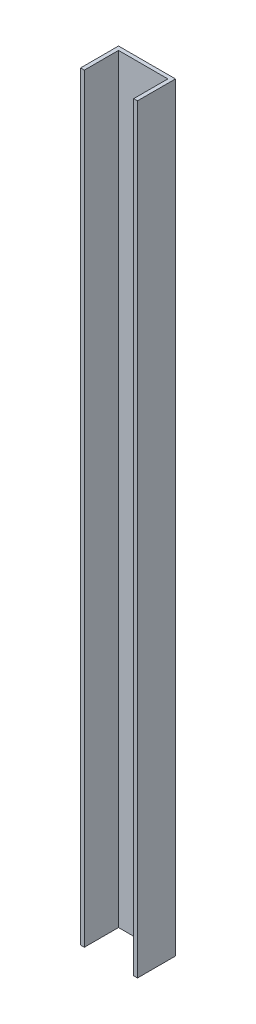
from build123d import *

# Parameters (mm, degrees)
SKETCH1_W           = 15
SKETCH1_H           = 200
BOSS_EXTRUDE3_DEPTH = 10
SKETCH3_W           = 13
SKETCH3_H           = 9
CUT_EXTRUDE2_DEPTH  = 201.81085628


with BuildPart() as part:
    # Sketch1 → Boss-Extrude3 (new body)
    with BuildSketch(Plane.XY):
        with Locations((7.5, 100)):
            Rectangle(SKETCH1_W, SKETCH1_H)
    extrude(amount=BOSS_EXTRUDE3_DEPTH)

    # Sketch3 → Cut-Extrude2 (cut, through all)
    with BuildSketch(Plane(origin=(0, 200, 0), x_dir=(1, 0, 0), z_dir=(0, 1, 0))):
        with Locations((7.5, -5.5)):
            Rectangle(SKETCH3_W, SKETCH3_H)
    extrude(amount=-CUT_EXTRUDE2_DEPTH, mode=Mode.SUBTRACT)


solid = part.part
